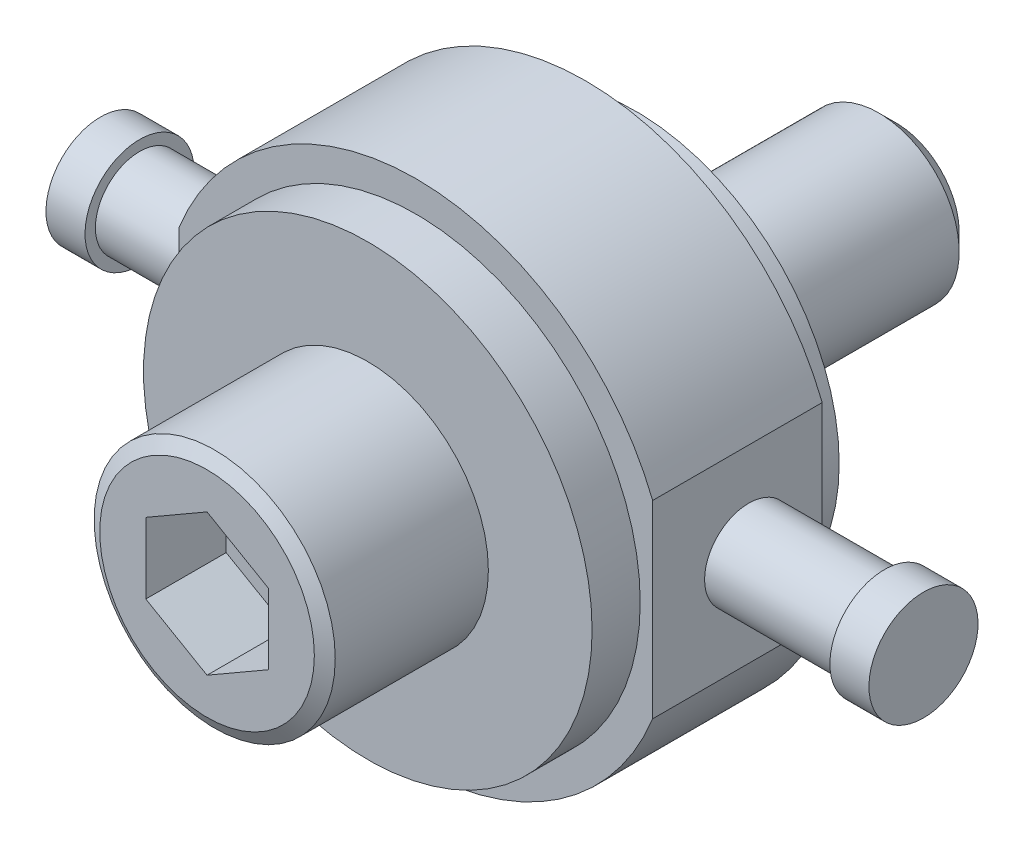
ISO-10303-21;
HEADER;
FILE_DESCRIPTION(('STEP AP214'),'2;1');
FILE_NAME('part.step','',(''),(''),'','','');
FILE_SCHEMA(('AUTOMOTIVE_DESIGN { 1 0 10303 214 1 1 1 1 }'));
ENDSEC;
DATA;
#1=APPLICATION_CONTEXT('core data for automotive mechanical design processes');
#2=APPLICATION_PROTOCOL_DEFINITION('international standard','automotive_design',2000,#1);
#3=PRODUCT_CONTEXT('',#1,'mechanical');
#4=PRODUCT('Part','Part','',(#3));
#5=PRODUCT_RELATED_PRODUCT_CATEGORY('part','',(#4));
#6=PRODUCT_DEFINITION_FORMATION('','',#4);
#7=PRODUCT_DEFINITION_CONTEXT('part definition',#1,'design');
#8=PRODUCT_DEFINITION('design','',#6,#7);
#9=PRODUCT_DEFINITION_SHAPE('','',#8);
#10=(LENGTH_UNIT() NAMED_UNIT(*) SI_UNIT(.MILLI.,.METRE.));
#11=(NAMED_UNIT(*) PLANE_ANGLE_UNIT() SI_UNIT($,.RADIAN.));
#12=(NAMED_UNIT(*) SI_UNIT($,.STERADIAN.) SOLID_ANGLE_UNIT());
#13=UNCERTAINTY_MEASURE_WITH_UNIT(LENGTH_MEASURE(1.E-05),#10,'distance_accuracy_value','');
#14=(GEOMETRIC_REPRESENTATION_CONTEXT(3) GLOBAL_UNCERTAINTY_ASSIGNED_CONTEXT((#13)) GLOBAL_UNIT_ASSIGNED_CONTEXT((#10,
#11,#12)) REPRESENTATION_CONTEXT('',''));
#15=CARTESIAN_POINT('',(0.,0.,0.));
#16=DIRECTION('',(0.,0.,1.));
#17=DIRECTION('',(1.,0.,0.));
#18=AXIS2_PLACEMENT_3D('',#15,#16,#17);
#19=CARTESIAN_POINT('',(0.,0.,0.));
#20=DIRECTION('',(0.,0.,1.));
#21=DIRECTION('',(1.,0.,0.));
#22=AXIS2_PLACEMENT_3D('',#19,#20,#21);
#23=PLANE('',#22);
#24=CARTESIAN_POINT('',(0.,0.,0.));
#25=DIRECTION('',(0.,0.,1.));
#26=DIRECTION('',(1.,0.,0.));
#27=AXIS2_PLACEMENT_3D('',#24,#25,#26);
#28=CIRCLE('',#27,53.15);
#29=CARTESIAN_POINT('',(53.15,0.,0.));
#30=VERTEX_POINT('',#29);
#31=EDGE_CURVE('E184',#30,#30,#28,.T.);
#32=ORIENTED_EDGE('',*,*,#31,.F.);
#33=EDGE_LOOP('',(#32));
#34=FACE_BOUND('',#33,.T.);
#35=CARTESIAN_POINT('',(0.,0.,0.));
#36=DIRECTION('',(0.,0.,-1.));
#37=DIRECTION('',(-1.,0.,0.));
#38=AXIS2_PLACEMENT_3D('',#35,#36,#37);
#39=CIRCLE('',#38,21.);
#40=CARTESIAN_POINT('',(-21.,0.,0.));
#41=VERTEX_POINT('',#40);
#42=EDGE_CURVE('E150',#41,#41,#39,.T.);
#43=ORIENTED_EDGE('',*,*,#42,.F.);
#44=EDGE_LOOP('',(#43));
#45=FACE_BOUND('',#44,.T.);
#46=ADVANCED_FACE('F14',(#34,#45),#23,.F.);
#47=CARTESIAN_POINT('',(97.3,0.,32.33));
#48=DIRECTION('',(-1.,0.,0.));
#49=DIRECTION('',(0.,-1.,0.));
#50=AXIS2_PLACEMENT_3D('',#47,#48,#49);
#51=PLANE('',#50);
#52=CARTESIAN_POINT('',(97.3,0.,32.33));
#53=DIRECTION('',(-1.,0.,0.));
#54=DIRECTION('',(0.,0.,1.));
#55=AXIS2_PLACEMENT_3D('',#52,#53,#54);
#56=CIRCLE('',#55,11.5325);
#57=CARTESIAN_POINT('',(97.3,0.,43.8625));
#58=VERTEX_POINT('',#57);
#59=EDGE_CURVE('E181',#58,#58,#56,.T.);
#60=ORIENTED_EDGE('',*,*,#59,.F.);
#61=EDGE_LOOP('',(#60));
#62=FACE_BOUND('',#61,.T.);
#63=CARTESIAN_POINT('',(97.3,0.,32.33));
#64=DIRECTION('',(-1.,0.,0.));
#65=DIRECTION('',(0.,-1.,0.));
#66=AXIS2_PLACEMENT_3D('',#63,#64,#65);
#67=CIRCLE('',#66,14.25);
#68=CARTESIAN_POINT('',(97.3,-14.25,32.33));
#69=VERTEX_POINT('',#68);
#70=EDGE_CURVE('E154',#69,#69,#67,.T.);
#71=ORIENTED_EDGE('',*,*,#70,.T.);
#72=EDGE_LOOP('',(#71));
#73=FACE_BOUND('',#72,.T.);
#74=ADVANCED_FACE('F243',(#62,#73),#51,.T.);
#75=CARTESIAN_POINT('',(-97.3,0.,32.33));
#76=DIRECTION('',(-1.,0.,0.));
#77=DIRECTION('',(0.,-1.,0.));
#78=AXIS2_PLACEMENT_3D('',#75,#76,#77);
#79=PLANE('',#78);
#80=CARTESIAN_POINT('',(-97.3,0.,32.33));
#81=DIRECTION('',(-1.,0.,0.));
#82=DIRECTION('',(0.,0.,1.));
#83=AXIS2_PLACEMENT_3D('',#80,#81,#82);
#84=CIRCLE('',#83,11.5325);
#85=CARTESIAN_POINT('',(-97.3,0.,43.8625));
#86=VERTEX_POINT('',#85);
#87=EDGE_CURVE('E157',#86,#86,#84,.F.);
#88=ORIENTED_EDGE('',*,*,#87,.F.);
#89=EDGE_LOOP('',(#88));
#90=FACE_BOUND('',#89,.T.);
#91=CARTESIAN_POINT('',(-97.3,0.,32.33));
#92=DIRECTION('',(-1.,0.,0.));
#93=DIRECTION('',(0.,-1.,0.));
#94=AXIS2_PLACEMENT_3D('',#91,#92,#93);
#95=CIRCLE('',#94,14.25);
#96=CARTESIAN_POINT('',(-97.3,-14.25,32.33));
#97=VERTEX_POINT('',#96);
#98=EDGE_CURVE('E9',#97,#97,#95,.T.);
#99=ORIENTED_EDGE('',*,*,#98,.F.);
#100=EDGE_LOOP('',(#99));
#101=FACE_BOUND('',#100,.T.);
#102=ADVANCED_FACE('F250',(#90,#101),#79,.F.);
#103=CARTESIAN_POINT('',(-103.85,0.,32.33));
#104=DIRECTION('',(1.,0.,0.));
#105=DIRECTION('',(0.,0.,-1.));
#106=AXIS2_PLACEMENT_3D('',#103,#104,#105);
#107=CYLINDRICAL_SURFACE('',#106,11.5325);
#108=CARTESIAN_POINT('',(-61.85,0.,32.33));
#109=DIRECTION('',(1.,0.,0.));
#110=DIRECTION('',(0.,0.,-1.));
#111=AXIS2_PLACEMENT_3D('',#108,#109,#110);
#112=CIRCLE('',#111,11.5325);
#113=CARTESIAN_POINT('',(-61.85,0.,20.7975));
#114=VERTEX_POINT('',#113);
#115=EDGE_CURVE('E174',#114,#114,#112,.T.);
#116=ORIENTED_EDGE('',*,*,#115,.F.);
#117=EDGE_LOOP('',(#116));
#118=FACE_BOUND('',#117,.T.);
#119=ORIENTED_EDGE('',*,*,#87,.T.);
#120=EDGE_LOOP('',(#119));
#121=FACE_BOUND('',#120,.T.);
#122=ADVANCED_FACE('F339',(#118,#121),#107,.T.);
#123=CARTESIAN_POINT('',(0.,0.,70.));
#124=DIRECTION('',(0.,0.,1.));
#125=DIRECTION('',(1.,0.,0.));
#126=AXIS2_PLACEMENT_3D('',#123,#124,#125);
#127=PLANE('',#126);
#128=CARTESIAN_POINT('',(0.,0.,70.));
#129=DIRECTION('',(0.,0.,1.));
#130=DIRECTION('',(1.,0.,0.));
#131=AXIS2_PLACEMENT_3D('',#128,#129,#130);
#132=CIRCLE('',#131,58.6);
#133=CARTESIAN_POINT('',(58.6,0.,70.));
#134=VERTEX_POINT('',#133);
#135=EDGE_CURVE('E170',#134,#134,#132,.T.);
#136=ORIENTED_EDGE('',*,*,#135,.T.);
#137=EDGE_LOOP('',(#136));
#138=FACE_BOUND('',#137,.T.);
#139=CARTESIAN_POINT('',(0.,0.,70.));
#140=DIRECTION('',(0.,0.,1.));
#141=DIRECTION('',(1.,0.,0.));
#142=AXIS2_PLACEMENT_3D('',#139,#140,#141);
#143=CIRCLE('',#142,31.5);
#144=CARTESIAN_POINT('',(31.5,0.,70.));
#145=VERTEX_POINT('',#144);
#146=EDGE_CURVE('E162',#145,#145,#143,.T.);
#147=ORIENTED_EDGE('',*,*,#146,.F.);
#148=EDGE_LOOP('',(#147));
#149=FACE_BOUND('',#148,.T.);
#150=ADVANCED_FACE('F296',(#138,#149),#127,.T.);
#151=CARTESIAN_POINT('',(0.,0.,57.43));
#152=DIRECTION('',(0.,0.,1.));
#153=DIRECTION('',(1.,0.,0.));
#154=AXIS2_PLACEMENT_3D('',#151,#152,#153);
#155=PLANE('',#154);
#156=CARTESIAN_POINT('',(0.,0.,57.43));
#157=DIRECTION('',(0.,0.,1.));
#158=DIRECTION('',(1.,0.,0.));
#159=AXIS2_PLACEMENT_3D('',#156,#157,#158);
#160=CIRCLE('',#159,66.6);
#161=CARTESIAN_POINT('',(-61.85,-24.7009615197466,57.43));
#162=VERTEX_POINT('',#161);
#163=CARTESIAN_POINT('',(61.85,-24.7009615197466,57.43));
#164=VERTEX_POINT('',#163);
#165=EDGE_CURVE('E173',#162,#164,#160,.T.);
#166=ORIENTED_EDGE('',*,*,#165,.T.);
#167=DIRECTION('',(0.,-1.,0.));
#168=VECTOR('',#167,1.);
#169=CARTESIAN_POINT('',(61.85,24.7009615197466,57.43));
#170=LINE('',#169,#168);
#171=CARTESIAN_POINT('',(61.85,24.7009615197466,57.43));
#172=VERTEX_POINT('',#171);
#173=EDGE_CURVE('E199',#172,#164,#170,.T.);
#174=ORIENTED_EDGE('',*,*,#173,.F.);
#175=CARTESIAN_POINT('',(0.,0.,57.43));
#176=DIRECTION('',(0.,0.,1.));
#177=DIRECTION('',(1.,0.,0.));
#178=AXIS2_PLACEMENT_3D('',#175,#176,#177);
#179=CIRCLE('',#178,66.6);
#180=CARTESIAN_POINT('',(-61.85,24.7009615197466,57.43));
#181=VERTEX_POINT('',#180);
#182=EDGE_CURVE('E200',#172,#181,#179,.T.);
#183=ORIENTED_EDGE('',*,*,#182,.T.);
#184=DIRECTION('',(0.,-1.,0.));
#185=VECTOR('',#184,1.);
#186=CARTESIAN_POINT('',(-61.85,24.7009615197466,57.43));
#187=LINE('',#186,#185);
#188=EDGE_CURVE('E196',#181,#162,#187,.T.);
#189=ORIENTED_EDGE('',*,*,#188,.T.);
#190=EDGE_LOOP('',(#166,#174,#183,#189));
#191=FACE_BOUND('',#190,.T.);
#192=CARTESIAN_POINT('',(0.,0.,57.43));
#193=DIRECTION('',(0.,0.,1.));
#194=DIRECTION('',(1.,0.,0.));
#195=AXIS2_PLACEMENT_3D('',#192,#193,#194);
#196=CIRCLE('',#195,58.6);
#197=CARTESIAN_POINT('',(58.6,0.,57.43));
#198=VERTEX_POINT('',#197);
#199=EDGE_CURVE('E166',#198,#198,#196,.T.);
#200=ORIENTED_EDGE('',*,*,#199,.F.);
#201=EDGE_LOOP('',(#200));
#202=FACE_BOUND('',#201,.T.);
#203=ADVANCED_FACE('F290',(#191,#202),#155,.T.);
#204=CARTESIAN_POINT('',(61.85,24.7009615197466,57.43));
#205=DIRECTION('',(1.,0.,0.));
#206=DIRECTION('',(0.,0.,-1.));
#207=AXIS2_PLACEMENT_3D('',#204,#205,#206);
#208=PLANE('',#207);
#209=DIRECTION('',(0.,0.,-1.));
#210=VECTOR('',#209,1.);
#211=CARTESIAN_POINT('',(61.85,24.7009615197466,57.43));
#212=LINE('',#211,#210);
#213=CARTESIAN_POINT('',(61.85,24.7009615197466,13.13));
#214=VERTEX_POINT('',#213);
#215=EDGE_CURVE('E187',#172,#214,#212,.T.);
#216=ORIENTED_EDGE('',*,*,#215,.F.);
#217=ORIENTED_EDGE('',*,*,#173,.T.);
#218=DIRECTION('',(0.,0.,-1.));
#219=VECTOR('',#218,1.);
#220=CARTESIAN_POINT('',(61.85,-24.7009615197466,57.43));
#221=LINE('',#220,#219);
#222=CARTESIAN_POINT('',(61.85,-24.7009615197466,13.13));
#223=VERTEX_POINT('',#222);
#224=EDGE_CURVE('E192',#164,#223,#221,.T.);
#225=ORIENTED_EDGE('',*,*,#224,.T.);
#226=DIRECTION('',(0.,-1.,0.));
#227=VECTOR('',#226,1.);
#228=CARTESIAN_POINT('',(61.85,24.7009615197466,13.13));
#229=LINE('',#228,#227);
#230=EDGE_CURVE('E188',#214,#223,#229,.T.);
#231=ORIENTED_EDGE('',*,*,#230,.F.);
#232=EDGE_LOOP('',(#216,#217,#225,#231));
#233=FACE_BOUND('',#232,.T.);
#234=CARTESIAN_POINT('',(61.85,0.,32.33));
#235=DIRECTION('',(1.,0.,0.));
#236=DIRECTION('',(0.,0.,-1.));
#237=AXIS2_PLACEMENT_3D('',#234,#235,#236);
#238=CIRCLE('',#237,11.5325);
#239=CARTESIAN_POINT('',(61.85,0.,20.7975));
#240=VERTEX_POINT('',#239);
#241=EDGE_CURVE('E169',#240,#240,#238,.T.);
#242=ORIENTED_EDGE('',*,*,#241,.F.);
#243=EDGE_LOOP('',(#242));
#244=FACE_BOUND('',#243,.T.);
#245=ADVANCED_FACE('F257',(#233,#244),#208,.T.);
#246=CARTESIAN_POINT('',(0.,0.,13.13));
#247=DIRECTION('',(0.,0.,1.));
#248=DIRECTION('',(1.,0.,0.));
#249=AXIS2_PLACEMENT_3D('',#246,#247,#248);
#250=PLANE('',#249);
#251=CARTESIAN_POINT('',(0.,0.,13.13));
#252=DIRECTION('',(0.,0.,1.));
#253=DIRECTION('',(1.,0.,0.));
#254=AXIS2_PLACEMENT_3D('',#251,#252,#253);
#255=CIRCLE('',#254,66.6);
#256=CARTESIAN_POINT('',(-61.85,-24.7009615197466,13.13));
#257=VERTEX_POINT('',#256);
#258=EDGE_CURVE('E193',#257,#223,#255,.T.);
#259=ORIENTED_EDGE('',*,*,#258,.F.);
#260=DIRECTION('',(0.,-1.,0.));
#261=VECTOR('',#260,1.);
#262=CARTESIAN_POINT('',(-61.85,24.7009615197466,13.13));
#263=LINE('',#262,#261);
#264=CARTESIAN_POINT('',(-61.85,24.7009615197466,13.13));
#265=VERTEX_POINT('',#264);
#266=EDGE_CURVE('E182',#265,#257,#263,.T.);
#267=ORIENTED_EDGE('',*,*,#266,.F.);
#268=CARTESIAN_POINT('',(0.,0.,13.13));
#269=DIRECTION('',(0.,0.,1.));
#270=DIRECTION('',(1.,0.,0.));
#271=AXIS2_PLACEMENT_3D('',#268,#269,#270);
#272=CIRCLE('',#271,66.6);
#273=EDGE_CURVE('E178',#214,#265,#272,.T.);
#274=ORIENTED_EDGE('',*,*,#273,.F.);
#275=ORIENTED_EDGE('',*,*,#230,.T.);
#276=EDGE_LOOP('',(#259,#267,#274,#275));
#277=FACE_BOUND('',#276,.T.);
#278=CARTESIAN_POINT('',(0.,0.,13.13));
#279=DIRECTION('',(0.,0.,1.));
#280=DIRECTION('',(1.,0.,0.));
#281=AXIS2_PLACEMENT_3D('',#278,#279,#280);
#282=CIRCLE('',#281,53.15);
#283=CARTESIAN_POINT('',(53.15,0.,13.13));
#284=VERTEX_POINT('',#283);
#285=EDGE_CURVE('E191',#284,#284,#282,.T.);
#286=ORIENTED_EDGE('',*,*,#285,.T.);
#287=EDGE_LOOP('',(#286));
#288=FACE_BOUND('',#287,.T.);
#289=ADVANCED_FACE('F278',(#277,#288),#250,.F.);
#290=CARTESIAN_POINT('',(0.,0.,57.43));
#291=DIRECTION('',(0.,0.,-1.));
#292=DIRECTION('',(-1.,0.,0.));
#293=AXIS2_PLACEMENT_3D('',#290,#291,#292);
#294=CYLINDRICAL_SURFACE('',#293,66.6);
#295=ORIENTED_EDGE('',*,*,#224,.F.);
#296=ORIENTED_EDGE('',*,*,#165,.F.);
#297=DIRECTION('',(0.,0.,-1.));
#298=VECTOR('',#297,1.);
#299=CARTESIAN_POINT('',(-61.85,-24.7009615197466,57.43));
#300=LINE('',#299,#298);
#301=EDGE_CURVE('E88',#162,#257,#300,.T.);
#302=ORIENTED_EDGE('',*,*,#301,.T.);
#303=ORIENTED_EDGE('',*,*,#258,.T.);
#304=EDGE_LOOP('',(#295,#296,#302,#303));
#305=FACE_BOUND('',#304,.T.);
#306=ADVANCED_FACE('F280',(#305),#294,.T.);
#307=CARTESIAN_POINT('',(0.,0.,57.43));
#308=DIRECTION('',(0.,0.,-1.));
#309=DIRECTION('',(-1.,0.,0.));
#310=AXIS2_PLACEMENT_3D('',#307,#308,#309);
#311=CYLINDRICAL_SURFACE('',#310,66.6);
#312=DIRECTION('',(0.,0.,-1.));
#313=VECTOR('',#312,1.);
#314=CARTESIAN_POINT('',(-61.85,24.7009615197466,57.43));
#315=LINE('',#314,#313);
#316=EDGE_CURVE('E177',#181,#265,#315,.T.);
#317=ORIENTED_EDGE('',*,*,#316,.F.);
#318=ORIENTED_EDGE('',*,*,#182,.F.);
#319=ORIENTED_EDGE('',*,*,#215,.T.);
#320=ORIENTED_EDGE('',*,*,#273,.T.);
#321=EDGE_LOOP('',(#317,#318,#319,#320));
#322=FACE_BOUND('',#321,.T.);
#323=ADVANCED_FACE('F272',(#322),#311,.T.);
#324=CARTESIAN_POINT('',(-61.85,24.7009615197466,57.43));
#325=DIRECTION('',(1.,0.,0.));
#326=DIRECTION('',(0.,0.,-1.));
#327=AXIS2_PLACEMENT_3D('',#324,#325,#326);
#328=PLANE('',#327);
#329=ORIENTED_EDGE('',*,*,#115,.T.);
#330=EDGE_LOOP('',(#329));
#331=FACE_BOUND('',#330,.T.);
#332=ORIENTED_EDGE('',*,*,#188,.F.);
#333=ORIENTED_EDGE('',*,*,#316,.T.);
#334=ORIENTED_EDGE('',*,*,#266,.T.);
#335=ORIENTED_EDGE('',*,*,#301,.F.);
#336=EDGE_LOOP('',(#332,#333,#334,#335));
#337=FACE_BOUND('',#336,.T.);
#338=ADVANCED_FACE('F262',(#331,#337),#328,.F.);
#339=CARTESIAN_POINT('',(0.,0.,13.13));
#340=DIRECTION('',(0.,0.,-1.));
#341=DIRECTION('',(-1.,0.,0.));
#342=AXIS2_PLACEMENT_3D('',#339,#340,#341);
#343=CYLINDRICAL_SURFACE('',#342,53.15);
#344=ORIENTED_EDGE('',*,*,#285,.F.);
#345=EDGE_LOOP('',(#344));
#346=FACE_BOUND('',#345,.T.);
#347=ORIENTED_EDGE('',*,*,#31,.T.);
#348=EDGE_LOOP('',(#347));
#349=FACE_BOUND('',#348,.T.);
#350=ADVANCED_FACE('F259',(#346,#349),#343,.T.);
#351=CARTESIAN_POINT('',(103.85,0.,32.33));
#352=DIRECTION('',(-1.,0.,0.));
#353=DIRECTION('',(0.,0.,1.));
#354=AXIS2_PLACEMENT_3D('',#351,#352,#353);
#355=CYLINDRICAL_SURFACE('',#354,11.5325);
#356=ORIENTED_EDGE('',*,*,#59,.T.);
#357=EDGE_LOOP('',(#356));
#358=FACE_BOUND('',#357,.T.);
#359=ORIENTED_EDGE('',*,*,#241,.T.);
#360=EDGE_LOOP('',(#359));
#361=FACE_BOUND('',#360,.T.);
#362=ADVANCED_FACE('F261',(#358,#361),#355,.T.);
#363=CARTESIAN_POINT('',(0.,0.,70.));
#364=DIRECTION('',(0.,0.,-1.));
#365=DIRECTION('',(-1.,0.,0.));
#366=AXIS2_PLACEMENT_3D('',#363,#364,#365);
#367=CYLINDRICAL_SURFACE('',#366,58.6);
#368=ORIENTED_EDGE('',*,*,#135,.F.);
#369=EDGE_LOOP('',(#368));
#370=FACE_BOUND('',#369,.T.);
#371=ORIENTED_EDGE('',*,*,#199,.T.);
#372=EDGE_LOOP('',(#371));
#373=FACE_BOUND('',#372,.T.);
#374=ADVANCED_FACE('F269',(#370,#373),#367,.T.);
#375=CARTESIAN_POINT('',(0.,0.,112.));
#376=DIRECTION('',(0.,0.,-1.));
#377=DIRECTION('',(-1.,0.,0.));
#378=AXIS2_PLACEMENT_3D('',#375,#376,#377);
#379=CYLINDRICAL_SURFACE('',#378,31.5);
#380=CARTESIAN_POINT('',(0.,0.,110.));
#381=DIRECTION('',(0.,0.,1.));
#382=DIRECTION('',(1.,0.,0.));
#383=AXIS2_PLACEMENT_3D('',#380,#381,#382);
#384=CIRCLE('',#383,31.5);
#385=CARTESIAN_POINT('',(31.5,0.,110.));
#386=VERTEX_POINT('',#385);
#387=EDGE_CURVE('E18',#386,#386,#384,.F.);
#388=ORIENTED_EDGE('',*,*,#387,.T.);
#389=EDGE_LOOP('',(#388));
#390=FACE_BOUND('',#389,.T.);
#391=ORIENTED_EDGE('',*,*,#146,.T.);
#392=EDGE_LOOP('',(#391));
#393=FACE_BOUND('',#392,.T.);
#394=ADVANCED_FACE('F315',(#390,#393),#379,.T.);
#395=CARTESIAN_POINT('',(0.,0.,112.));
#396=DIRECTION('',(0.,0.,1.));
#397=DIRECTION('',(1.,0.,0.));
#398=AXIS2_PLACEMENT_3D('',#395,#396,#397);
#399=PLANE('',#398);
#400=DIRECTION('',(-0.866025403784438,0.5,0.));
#401=VECTOR('',#400,1.);
#402=CARTESIAN_POINT('',(16.,9.23760430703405,112.));
#403=LINE('',#402,#401);
#404=CARTESIAN_POINT('',(16.,9.23760430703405,112.));
#405=VERTEX_POINT('',#404);
#406=CARTESIAN_POINT('',(0.,18.475208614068,112.));
#407=VERTEX_POINT('',#406);
#408=EDGE_CURVE('E94',#405,#407,#403,.T.);
#409=ORIENTED_EDGE('',*,*,#408,.F.);
#410=DIRECTION('',(0.,1.,0.));
#411=VECTOR('',#410,1.);
#412=CARTESIAN_POINT('',(16.,-9.23760430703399,112.));
#413=LINE('',#412,#411);
#414=CARTESIAN_POINT('',(16.,-9.23760430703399,112.));
#415=VERTEX_POINT('',#414);
#416=EDGE_CURVE('E142',#415,#405,#413,.T.);
#417=ORIENTED_EDGE('',*,*,#416,.F.);
#418=DIRECTION('',(0.866025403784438,0.5,0.));
#419=VECTOR('',#418,1.);
#420=CARTESIAN_POINT('',(0.,-18.475208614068,112.));
#421=LINE('',#420,#419);
#422=CARTESIAN_POINT('',(0.,-18.475208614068,112.));
#423=VERTEX_POINT('',#422);
#424=EDGE_CURVE('E138',#423,#415,#421,.T.);
#425=ORIENTED_EDGE('',*,*,#424,.F.);
#426=DIRECTION('',(0.866025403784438,-0.5,0.));
#427=VECTOR('',#426,1.);
#428=CARTESIAN_POINT('',(-16.,-9.23760430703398,112.));
#429=LINE('',#428,#427);
#430=CARTESIAN_POINT('',(-16.,-9.23760430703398,112.));
#431=VERTEX_POINT('',#430);
#432=EDGE_CURVE('E134',#431,#423,#429,.T.);
#433=ORIENTED_EDGE('',*,*,#432,.F.);
#434=DIRECTION('',(0.,-1.,0.));
#435=VECTOR('',#434,1.);
#436=CARTESIAN_POINT('',(-16.,9.23760430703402,112.));
#437=LINE('',#436,#435);
#438=CARTESIAN_POINT('',(-16.,9.23760430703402,112.));
#439=VERTEX_POINT('',#438);
#440=EDGE_CURVE('E130',#439,#431,#437,.T.);
#441=ORIENTED_EDGE('',*,*,#440,.F.);
#442=DIRECTION('',(-0.866025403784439,-0.5,0.));
#443=VECTOR('',#442,1.);
#444=CARTESIAN_POINT('',(0.,18.475208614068,112.));
#445=LINE('',#444,#443);
#446=EDGE_CURVE('E103',#407,#439,#445,.T.);
#447=ORIENTED_EDGE('',*,*,#446,.F.);
#448=EDGE_LOOP('',(#409,#417,#425,#433,#441,#447));
#449=FACE_BOUND('',#448,.T.);
#450=CARTESIAN_POINT('',(0.,0.,112.));
#451=DIRECTION('',(0.,0.,1.));
#452=DIRECTION('',(1.,0.,0.));
#453=AXIS2_PLACEMENT_3D('',#450,#451,#452);
#454=CIRCLE('',#453,28.0358983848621);
#455=CARTESIAN_POINT('',(28.0358983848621,0.,112.));
#456=VERTEX_POINT('',#455);
#457=EDGE_CURVE('E165',#456,#456,#454,.T.);
#458=ORIENTED_EDGE('',*,*,#457,.T.);
#459=EDGE_LOOP('',(#458));
#460=FACE_BOUND('',#459,.T.);
#461=ADVANCED_FACE('F225',(#449,#460),#399,.T.);
#462=CARTESIAN_POINT('',(0.,0.,-68.));
#463=DIRECTION('',(0.,0.,1.));
#464=DIRECTION('',(1.,0.,0.));
#465=AXIS2_PLACEMENT_3D('',#462,#463,#464);
#466=CYLINDRICAL_SURFACE('',#465,21.);
#467=CARTESIAN_POINT('',(0.,0.,-63.5));
#468=DIRECTION('',(0.,0.,-1.));
#469=DIRECTION('',(-1.,0.,0.));
#470=AXIS2_PLACEMENT_3D('',#467,#468,#469);
#471=CIRCLE('',#470,21.);
#472=CARTESIAN_POINT('',(-21.,0.,-63.5));
#473=VERTEX_POINT('',#472);
#474=EDGE_CURVE('E153',#473,#473,#471,.F.);
#475=ORIENTED_EDGE('',*,*,#474,.T.);
#476=EDGE_LOOP('',(#475));
#477=FACE_BOUND('',#476,.T.);
#478=ORIENTED_EDGE('',*,*,#42,.T.);
#479=EDGE_LOOP('',(#478));
#480=FACE_BOUND('',#479,.T.);
#481=ADVANCED_FACE('F240',(#477,#480),#466,.T.);
#482=CARTESIAN_POINT('',(0.,0.,-68.));
#483=DIRECTION('',(0.,0.,-1.));
#484=DIRECTION('',(-1.,0.,0.));
#485=AXIS2_PLACEMENT_3D('',#482,#483,#484);
#486=PLANE('',#485);
#487=CARTESIAN_POINT('',(0.,0.,-68.));
#488=DIRECTION('',(0.,0.,-1.));
#489=DIRECTION('',(-1.,0.,0.));
#490=AXIS2_PLACEMENT_3D('',#487,#488,#489);
#491=CIRCLE('',#490,16.5);
#492=CARTESIAN_POINT('',(-16.5,0.,-68.));
#493=VERTEX_POINT('',#492);
#494=EDGE_CURVE('E128',#493,#493,#491,.T.);
#495=ORIENTED_EDGE('',*,*,#494,.T.);
#496=EDGE_LOOP('',(#495));
#497=FACE_BOUND('',#496,.T.);
#498=ADVANCED_FACE('F238',(#497),#486,.T.);
#499=CARTESIAN_POINT('',(0.,0.,-68.));
#500=DIRECTION('',(0.,0.,1.));
#501=DIRECTION('',(1.,0.,0.));
#502=AXIS2_PLACEMENT_3D('',#499,#500,#501);
#503=CONICAL_SURFACE('',#502,16.5,0.785398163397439);
#504=ORIENTED_EDGE('',*,*,#474,.F.);
#505=EDGE_LOOP('',(#504));
#506=FACE_BOUND('',#505,.T.);
#507=ORIENTED_EDGE('',*,*,#494,.F.);
#508=EDGE_LOOP('',(#507));
#509=FACE_BOUND('',#508,.T.);
#510=ADVANCED_FACE('F228',(#506,#509),#503,.T.);
#511=CARTESIAN_POINT('',(0.,0.,112.));
#512=DIRECTION('',(0.,0.,-1.));
#513=DIRECTION('',(-1.,0.,0.));
#514=AXIS2_PLACEMENT_3D('',#511,#512,#513);
#515=CONICAL_SURFACE('',#514,28.0358983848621,1.0471975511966);
#516=ORIENTED_EDGE('',*,*,#387,.F.);
#517=EDGE_LOOP('',(#516));
#518=FACE_BOUND('',#517,.T.);
#519=ORIENTED_EDGE('',*,*,#457,.F.);
#520=EDGE_LOOP('',(#519));
#521=FACE_BOUND('',#520,.T.);
#522=ADVANCED_FACE('F16',(#518,#521),#515,.T.);
#523=CARTESIAN_POINT('',(16.,9.23760430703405,91.));
#524=DIRECTION('',(0.5,0.866025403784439,0.));
#525=DIRECTION('',(-0.866025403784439,0.5,0.));
#526=AXIS2_PLACEMENT_3D('',#523,#524,#525);
#527=PLANE('',#526);
#528=ORIENTED_EDGE('',*,*,#408,.T.);
#529=DIRECTION('',(0.,0.,1.));
#530=VECTOR('',#529,1.);
#531=CARTESIAN_POINT('',(0.,18.475208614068,91.));
#532=LINE('',#531,#530);
#533=CARTESIAN_POINT('',(0.,18.475208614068,91.));
#534=VERTEX_POINT('',#533);
#535=EDGE_CURVE('E97',#534,#407,#532,.T.);
#536=ORIENTED_EDGE('',*,*,#535,.F.);
#537=DIRECTION('',(-0.866025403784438,0.5,0.));
#538=VECTOR('',#537,1.);
#539=CARTESIAN_POINT('',(16.,9.23760430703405,91.));
#540=LINE('',#539,#538);
#541=CARTESIAN_POINT('',(16.,9.23760430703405,91.));
#542=VERTEX_POINT('',#541);
#543=EDGE_CURVE('E100',#542,#534,#540,.T.);
#544=ORIENTED_EDGE('',*,*,#543,.F.);
#545=DIRECTION('',(0.,0.,1.));
#546=VECTOR('',#545,1.);
#547=CARTESIAN_POINT('',(16.,9.23760430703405,91.));
#548=LINE('',#547,#546);
#549=EDGE_CURVE('E127',#542,#405,#548,.T.);
#550=ORIENTED_EDGE('',*,*,#549,.T.);
#551=EDGE_LOOP('',(#528,#536,#544,#550));
#552=FACE_BOUND('',#551,.T.);
#553=ADVANCED_FACE('F98',(#552),#527,.F.);
#554=CARTESIAN_POINT('',(16.,-9.23760430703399,91.));
#555=DIRECTION('',(1.,0.,0.));
#556=DIRECTION('',(0.,1.,0.));
#557=AXIS2_PLACEMENT_3D('',#554,#555,#556);
#558=PLANE('',#557);
#559=ORIENTED_EDGE('',*,*,#416,.T.);
#560=ORIENTED_EDGE('',*,*,#549,.F.);
#561=DIRECTION('',(0.,1.,0.));
#562=VECTOR('',#561,1.);
#563=CARTESIAN_POINT('',(16.,-9.23760430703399,91.));
#564=LINE('',#563,#562);
#565=CARTESIAN_POINT('',(16.,-9.23760430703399,91.));
#566=VERTEX_POINT('',#565);
#567=EDGE_CURVE('E115',#566,#542,#564,.T.);
#568=ORIENTED_EDGE('',*,*,#567,.F.);
#569=DIRECTION('',(0.,0.,1.));
#570=VECTOR('',#569,1.);
#571=CARTESIAN_POINT('',(16.,-9.23760430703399,91.));
#572=LINE('',#571,#570);
#573=EDGE_CURVE('E141',#566,#415,#572,.T.);
#574=ORIENTED_EDGE('',*,*,#573,.T.);
#575=EDGE_LOOP('',(#559,#560,#568,#574));
#576=FACE_BOUND('',#575,.T.);
#577=ADVANCED_FACE('F236',(#576),#558,.F.);
#578=CARTESIAN_POINT('',(0.,-18.475208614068,91.));
#579=DIRECTION('',(0.5,-0.866025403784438,0.));
#580=DIRECTION('',(0.866025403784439,0.5,0.));
#581=AXIS2_PLACEMENT_3D('',#578,#579,#580);
#582=PLANE('',#581);
#583=ORIENTED_EDGE('',*,*,#424,.T.);
#584=ORIENTED_EDGE('',*,*,#573,.F.);
#585=DIRECTION('',(0.866025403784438,0.5,0.));
#586=VECTOR('',#585,1.);
#587=CARTESIAN_POINT('',(0.,-18.475208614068,91.));
#588=LINE('',#587,#586);
#589=CARTESIAN_POINT('',(0.,-18.475208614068,91.));
#590=VERTEX_POINT('',#589);
#591=EDGE_CURVE('E122',#590,#566,#588,.T.);
#592=ORIENTED_EDGE('',*,*,#591,.F.);
#593=DIRECTION('',(0.,0.,1.));
#594=VECTOR('',#593,1.);
#595=CARTESIAN_POINT('',(0.,-18.475208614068,91.));
#596=LINE('',#595,#594);
#597=EDGE_CURVE('E137',#590,#423,#596,.T.);
#598=ORIENTED_EDGE('',*,*,#597,.T.);
#599=EDGE_LOOP('',(#583,#584,#592,#598));
#600=FACE_BOUND('',#599,.T.);
#601=ADVANCED_FACE('F394',(#600),#582,.F.);
#602=CARTESIAN_POINT('',(-16.,-9.23760430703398,91.));
#603=DIRECTION('',(-0.5,-0.866025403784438,0.));
#604=DIRECTION('',(0.866025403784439,-0.5,0.));
#605=AXIS2_PLACEMENT_3D('',#602,#603,#604);
#606=PLANE('',#605);
#607=ORIENTED_EDGE('',*,*,#432,.T.);
#608=ORIENTED_EDGE('',*,*,#597,.F.);
#609=DIRECTION('',(0.866025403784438,-0.5,0.));
#610=VECTOR('',#609,1.);
#611=CARTESIAN_POINT('',(-16.,-9.23760430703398,91.));
#612=LINE('',#611,#610);
#613=CARTESIAN_POINT('',(-16.,-9.23760430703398,91.));
#614=VERTEX_POINT('',#613);
#615=EDGE_CURVE('E119',#614,#590,#612,.T.);
#616=ORIENTED_EDGE('',*,*,#615,.F.);
#617=DIRECTION('',(0.,0.,1.));
#618=VECTOR('',#617,1.);
#619=CARTESIAN_POINT('',(-16.,-9.23760430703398,91.));
#620=LINE('',#619,#618);
#621=EDGE_CURVE('E133',#614,#431,#620,.T.);
#622=ORIENTED_EDGE('',*,*,#621,.T.);
#623=EDGE_LOOP('',(#607,#608,#616,#622));
#624=FACE_BOUND('',#623,.T.);
#625=ADVANCED_FACE('F390',(#624),#606,.F.);
#626=CARTESIAN_POINT('',(-16.,9.23760430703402,91.));
#627=DIRECTION('',(-1.,0.,0.));
#628=DIRECTION('',(0.,-1.,0.));
#629=AXIS2_PLACEMENT_3D('',#626,#627,#628);
#630=PLANE('',#629);
#631=ORIENTED_EDGE('',*,*,#440,.T.);
#632=ORIENTED_EDGE('',*,*,#621,.F.);
#633=DIRECTION('',(0.,-1.,0.));
#634=VECTOR('',#633,1.);
#635=CARTESIAN_POINT('',(-16.,9.23760430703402,91.));
#636=LINE('',#635,#634);
#637=CARTESIAN_POINT('',(-16.,9.23760430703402,91.));
#638=VERTEX_POINT('',#637);
#639=EDGE_CURVE('E110',#638,#614,#636,.T.);
#640=ORIENTED_EDGE('',*,*,#639,.F.);
#641=DIRECTION('',(0.,0.,1.));
#642=VECTOR('',#641,1.);
#643=CARTESIAN_POINT('',(-16.,9.23760430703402,91.));
#644=LINE('',#643,#642);
#645=EDGE_CURVE('E33',#638,#439,#644,.T.);
#646=ORIENTED_EDGE('',*,*,#645,.T.);
#647=EDGE_LOOP('',(#631,#632,#640,#646));
#648=FACE_BOUND('',#647,.T.);
#649=ADVANCED_FACE('F387',(#648),#630,.F.);
#650=CARTESIAN_POINT('',(0.,18.475208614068,91.));
#651=DIRECTION('',(-0.5,0.866025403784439,0.));
#652=DIRECTION('',(-0.866025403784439,-0.5,0.));
#653=AXIS2_PLACEMENT_3D('',#650,#651,#652);
#654=PLANE('',#653);
#655=ORIENTED_EDGE('',*,*,#446,.T.);
#656=ORIENTED_EDGE('',*,*,#645,.F.);
#657=DIRECTION('',(-0.866025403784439,-0.5,0.));
#658=VECTOR('',#657,1.);
#659=CARTESIAN_POINT('',(0.,18.475208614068,91.));
#660=LINE('',#659,#658);
#661=EDGE_CURVE('E106',#534,#638,#660,.T.);
#662=ORIENTED_EDGE('',*,*,#661,.F.);
#663=ORIENTED_EDGE('',*,*,#535,.T.);
#664=EDGE_LOOP('',(#655,#656,#662,#663));
#665=FACE_BOUND('',#664,.T.);
#666=ADVANCED_FACE('F107',(#665),#654,.F.);
#667=CARTESIAN_POINT('',(0.,18.475208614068,91.));
#668=DIRECTION('',(0.,0.,1.));
#669=DIRECTION('',(1.,0.,0.));
#670=AXIS2_PLACEMENT_3D('',#667,#668,#669);
#671=PLANE('',#670);
#672=ORIENTED_EDGE('',*,*,#543,.T.);
#673=ORIENTED_EDGE('',*,*,#661,.T.);
#674=ORIENTED_EDGE('',*,*,#639,.T.);
#675=ORIENTED_EDGE('',*,*,#615,.T.);
#676=ORIENTED_EDGE('',*,*,#591,.T.);
#677=ORIENTED_EDGE('',*,*,#567,.T.);
#678=EDGE_LOOP('',(#672,#673,#674,#675,#676,#677));
#679=FACE_BOUND('',#678,.T.);
#680=ADVANCED_FACE('F112',(#679),#671,.T.);
#681=CARTESIAN_POINT('',(107.5,0.,32.33));
#682=DIRECTION('',(-1.,0.,0.));
#683=DIRECTION('',(0.,-1.,0.));
#684=AXIS2_PLACEMENT_3D('',#681,#682,#683);
#685=PLANE('',#684);
#686=CARTESIAN_POINT('',(107.5,0.,32.33));
#687=DIRECTION('',(-1.,0.,0.));
#688=DIRECTION('',(0.,-1.,0.));
#689=AXIS2_PLACEMENT_3D('',#686,#687,#688);
#690=CIRCLE('',#689,14.25);
#691=CARTESIAN_POINT('',(107.5,-14.25,32.33));
#692=VERTEX_POINT('',#691);
#693=EDGE_CURVE('E125',#692,#692,#690,.T.);
#694=ORIENTED_EDGE('',*,*,#693,.F.);
#695=EDGE_LOOP('',(#694));
#696=FACE_BOUND('',#695,.T.);
#697=ADVANCED_FACE('F375',(#696),#685,.F.);
#698=CARTESIAN_POINT('',(107.5,0.,32.33));
#699=DIRECTION('',(-1.,0.,0.));
#700=DIRECTION('',(0.,-1.,0.));
#701=AXIS2_PLACEMENT_3D('',#698,#699,#700);
#702=CYLINDRICAL_SURFACE('',#701,14.25);
#703=ORIENTED_EDGE('',*,*,#693,.T.);
#704=EDGE_LOOP('',(#703));
#705=FACE_BOUND('',#704,.T.);
#706=ORIENTED_EDGE('',*,*,#70,.F.);
#707=EDGE_LOOP('',(#706));
#708=FACE_BOUND('',#707,.T.);
#709=ADVANCED_FACE('F368',(#705,#708),#702,.T.);
#710=CARTESIAN_POINT('',(-107.5,0.,32.33));
#711=DIRECTION('',(-1.,0.,0.));
#712=DIRECTION('',(0.,-1.,0.));
#713=AXIS2_PLACEMENT_3D('',#710,#711,#712);
#714=PLANE('',#713);
#715=CARTESIAN_POINT('',(-107.5,0.,32.33));
#716=DIRECTION('',(-1.,0.,0.));
#717=DIRECTION('',(0.,-1.,0.));
#718=AXIS2_PLACEMENT_3D('',#715,#716,#717);
#719=CIRCLE('',#718,14.25);
#720=CARTESIAN_POINT('',(-107.5,-14.25,32.33));
#721=VERTEX_POINT('',#720);
#722=EDGE_CURVE('E24',#721,#721,#719,.T.);
#723=ORIENTED_EDGE('',*,*,#722,.T.);
#724=EDGE_LOOP('',(#723));
#725=FACE_BOUND('',#724,.T.);
#726=ADVANCED_FACE('F362',(#725),#714,.T.);
#727=CARTESIAN_POINT('',(-107.5,0.,32.33));
#728=DIRECTION('',(1.,0.,0.));
#729=DIRECTION('',(0.,1.,0.));
#730=AXIS2_PLACEMENT_3D('',#727,#728,#729);
#731=CYLINDRICAL_SURFACE('',#730,14.25);
#732=ORIENTED_EDGE('',*,*,#722,.F.);
#733=EDGE_LOOP('',(#732));
#734=FACE_BOUND('',#733,.T.);
#735=ORIENTED_EDGE('',*,*,#98,.T.);
#736=EDGE_LOOP('',(#735));
#737=FACE_BOUND('',#736,.T.);
#738=ADVANCED_FACE('F336',(#734,#737),#731,.T.);
#739=CLOSED_SHELL('',(#46,#74,#102,#122,#150,#203,#245,#289,#306,#323,#338,#350,#362,#374,#394,
#461,#481,#498,#510,#522,#553,#577,#601,#625,#649,#666,#680,#697,#709,#726,#738));
#740=MANIFOLD_SOLID_BREP('B1',#739);
#741=ADVANCED_BREP_SHAPE_REPRESENTATION('',(#18,#740),#14);
#742=SHAPE_DEFINITION_REPRESENTATION(#9,#741);
ENDSEC;
END-ISO-10303-21;
